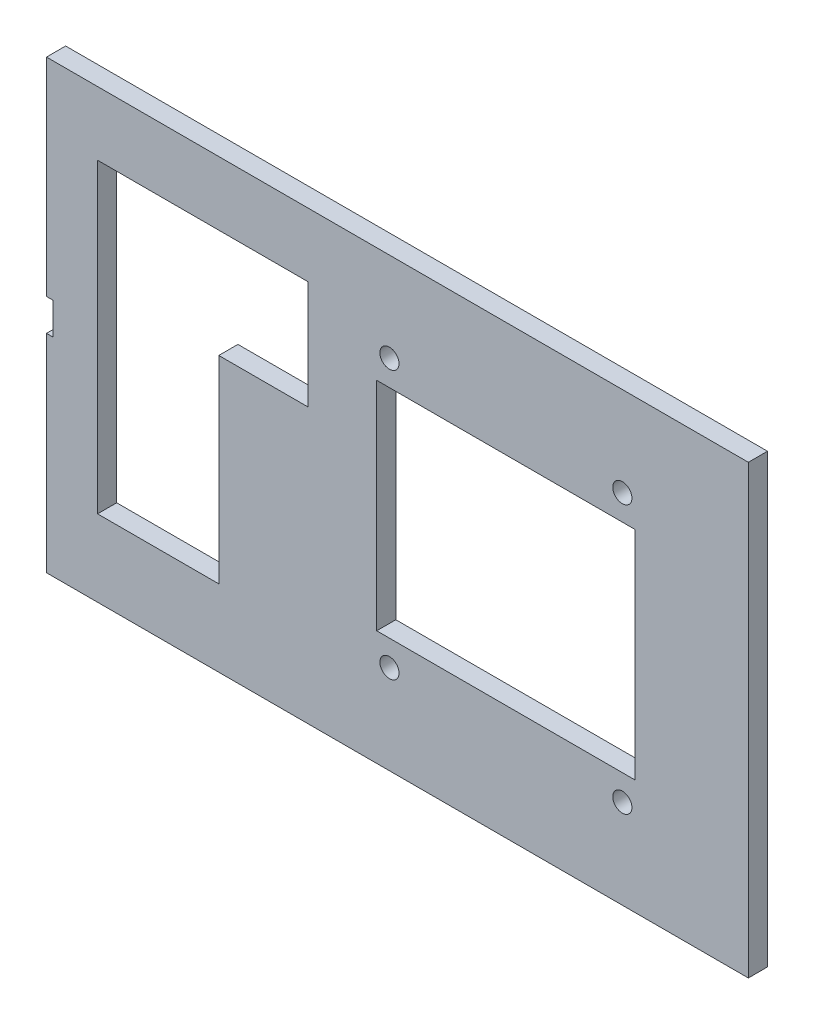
from build123d import *

# Parameters (mm, degrees)
SKETCH1_W               = 110
SKETCH1_H               = 70
BOSS_EXTRUDE1_DEPTH     = 3
CUT_EXTRUDE1_DEPTH      = 15
CUT_EXTRUDE1_DEPTH_BACK = 15
SKETCH2_W               = 2
SKETCH2_H               = 5
CUT_EXTRUDE2_DEPTH      = 10
CUT_EXTRUDE2_DEPTH_BACK = 10
SKETCH3_W               = 40.5
SKETCH3_H               = 34
CUT_EXTRUDE4_DEPTH      = 10
CUT_EXTRUDE4_DEPTH_BACK = 10
SKETCH5_R               = 1.5
CUT_EXTRUDE5_DEPTH      = 10
CUT_EXTRUDE5_DEPTH_BACK = 10
SKETCH6_W               = 19
SKETCH6_H               = 31
SKETCH6_W_2             = 33
SKETCH6_H_2             = 17


with BuildPart() as part:
    # Sketch1 → Boss-Extrude1 (new body)
    with BuildSketch(Plane.XY):
        Rectangle(SKETCH1_W, SKETCH1_H)
    extrude(amount=BOSS_EXTRUDE1_DEPTH)

    # Sketch2 → Cut-Extrude1 (cut, two sides: drawn at the far end of the back side and taken through both)
    with BuildSketch(Plane.XY.offset(3).offset(-CUT_EXTRUDE1_DEPTH_BACK)):
        with Locations((-55, 0)):
            Rectangle(SKETCH2_W, SKETCH2_H)
    extrude(amount=CUT_EXTRUDE1_DEPTH + CUT_EXTRUDE1_DEPTH_BACK, mode=Mode.SUBTRACT)

    # Sketch3 → Cut-Extrude2 (cut, two sides: drawn at the far end of the back side and taken through both)
    with BuildSketch(Plane.XY.offset(3).offset(-CUT_EXTRUDE2_DEPTH_BACK)):
        with Locations((17, 0)):
            Rectangle(SKETCH3_W, SKETCH3_H)
    extrude(amount=CUT_EXTRUDE2_DEPTH + CUT_EXTRUDE2_DEPTH_BACK, mode=Mode.SUBTRACT)

    # Sketch5 → Cut-Extrude4 (cut, two sides: drawn at the far end of the back side and taken through both)
    with BuildSketch(Plane(origin=(0, 0, 0), x_dir=(-1, 0, 0), z_dir=(0, 0, -1)).offset(-CUT_EXTRUDE4_DEPTH_BACK)):
        with Locations(Location((-35.25, 21, 0), (0, 0, 180))):
            Circle(SKETCH5_R)
        with Locations(Location((1.25, 21, 0), (0, 0, 180))):
            Circle(SKETCH5_R)
        with Locations(Location((-35.25, -21, 0), (0, 0, 180))):
            Circle(SKETCH5_R)
        with Locations(Location((1.25, -21, 0), (0, 0, 180))):
            Circle(SKETCH5_R)
    extrude(amount=CUT_EXTRUDE4_DEPTH + CUT_EXTRUDE4_DEPTH_BACK, mode=Mode.SUBTRACT)

    # Sketch6 → Cut-Extrude5 (cut, two sides: drawn at the far end of the back side and taken through both)
    with BuildSketch(Plane(origin=(0, 0, 0), x_dir=(-1, 0, 0), z_dir=(0, 0, -1)).offset(-CUT_EXTRUDE5_DEPTH_BACK)):
        with Locations((37.5, -7.5)):
            Rectangle(SKETCH6_W, SKETCH6_H)
        with Locations((30.5, 16.5)):
            Rectangle(SKETCH6_W_2, SKETCH6_H_2)
    extrude(amount=CUT_EXTRUDE5_DEPTH + CUT_EXTRUDE5_DEPTH_BACK, mode=Mode.SUBTRACT)


solid = part.part
